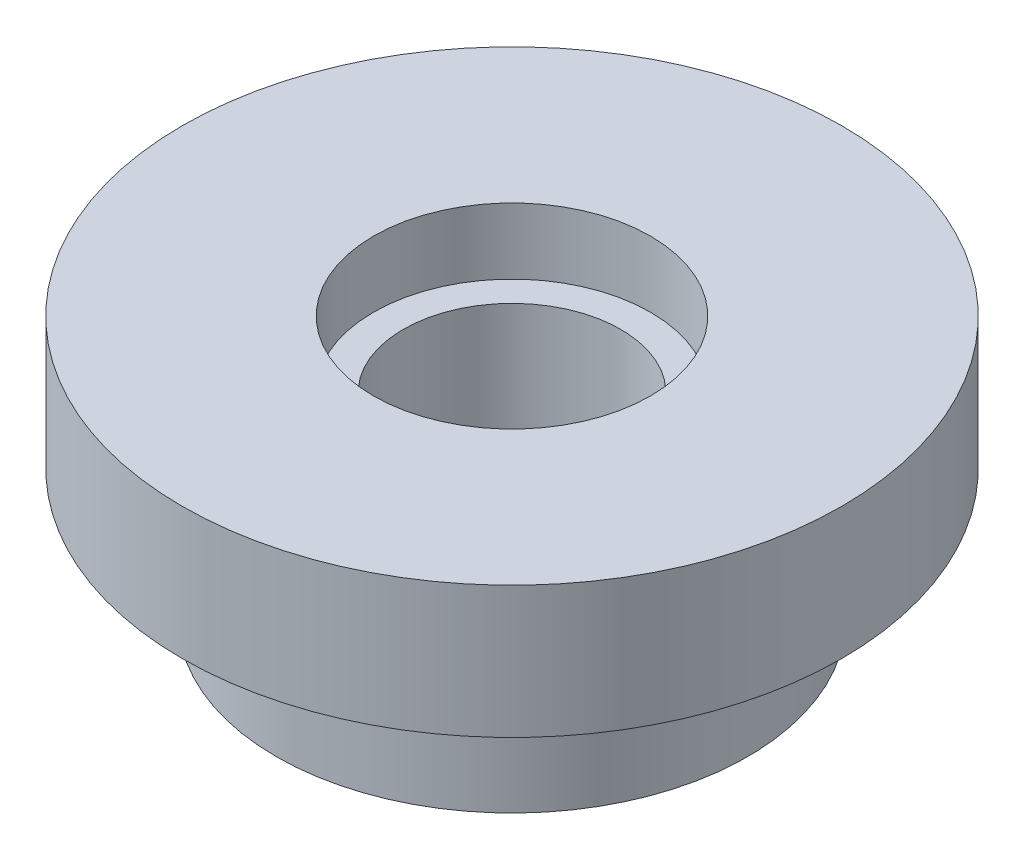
ISO-10303-21;
HEADER;
FILE_DESCRIPTION(('STEP AP214'),'2;1');
FILE_NAME('part.step','',(''),(''),'','','');
FILE_SCHEMA(('AUTOMOTIVE_DESIGN { 1 0 10303 214 1 1 1 1 }'));
ENDSEC;
DATA;
#1=APPLICATION_CONTEXT('core data for automotive mechanical design processes');
#2=APPLICATION_PROTOCOL_DEFINITION('international standard','automotive_design',2000,#1);
#3=PRODUCT_CONTEXT('',#1,'mechanical');
#4=PRODUCT('Part','Part','',(#3));
#5=PRODUCT_RELATED_PRODUCT_CATEGORY('part','',(#4));
#6=PRODUCT_DEFINITION_FORMATION('','',#4);
#7=PRODUCT_DEFINITION_CONTEXT('part definition',#1,'design');
#8=PRODUCT_DEFINITION('design','',#6,#7);
#9=PRODUCT_DEFINITION_SHAPE('','',#8);
#10=(LENGTH_UNIT() NAMED_UNIT(*) SI_UNIT(.MILLI.,.METRE.));
#11=(NAMED_UNIT(*) PLANE_ANGLE_UNIT() SI_UNIT($,.RADIAN.));
#12=(NAMED_UNIT(*) SI_UNIT($,.STERADIAN.) SOLID_ANGLE_UNIT());
#13=UNCERTAINTY_MEASURE_WITH_UNIT(LENGTH_MEASURE(1.E-05),#10,'distance_accuracy_value','');
#14=(GEOMETRIC_REPRESENTATION_CONTEXT(3) GLOBAL_UNCERTAINTY_ASSIGNED_CONTEXT((#13)) GLOBAL_UNIT_ASSIGNED_CONTEXT((#10,
#11,#12)) REPRESENTATION_CONTEXT('',''));
#15=CARTESIAN_POINT('',(0.,0.,0.));
#16=DIRECTION('',(0.,0.,1.));
#17=DIRECTION('',(1.,0.,0.));
#18=AXIS2_PLACEMENT_3D('',#15,#16,#17);
#19=CARTESIAN_POINT('',(0.,0.,0.));
#20=DIRECTION('',(0.,1.,0.));
#21=DIRECTION('',(0.,0.,1.));
#22=AXIS2_PLACEMENT_3D('',#19,#20,#21);
#23=PLANE('',#22);
#24=CARTESIAN_POINT('',(0.,0.,0.));
#25=DIRECTION('',(0.,1.,0.));
#26=DIRECTION('',(0.,0.,1.));
#27=AXIS2_PLACEMENT_3D('',#24,#25,#26);
#28=CIRCLE('',#27,16.5);
#29=CARTESIAN_POINT('',(0.,0.,16.5));
#30=VERTEX_POINT('',#29);
#31=EDGE_CURVE('E38',#30,#30,#28,.T.);
#32=ORIENTED_EDGE('',*,*,#31,.T.);
#33=EDGE_LOOP('',(#32));
#34=FACE_BOUND('',#33,.T.);
#35=CARTESIAN_POINT('',(0.,0.,0.));
#36=DIRECTION('',(0.,-1.,0.));
#37=DIRECTION('',(0.,0.,-1.));
#38=AXIS2_PLACEMENT_3D('',#35,#36,#37);
#39=CIRCLE('',#38,35.75);
#40=CARTESIAN_POINT('',(0.,0.,-35.75));
#41=VERTEX_POINT('',#40);
#42=EDGE_CURVE('E57',#41,#41,#39,.T.);
#43=ORIENTED_EDGE('',*,*,#42,.T.);
#44=EDGE_LOOP('',(#43));
#45=FACE_BOUND('',#44,.T.);
#46=ADVANCED_FACE('F30',(#34,#45),#23,.F.);
#47=CARTESIAN_POINT('',(0.,40.,0.));
#48=DIRECTION('',(0.,-1.,0.));
#49=DIRECTION('',(0.,0.,-1.));
#50=AXIS2_PLACEMENT_3D('',#47,#48,#49);
#51=CYLINDRICAL_SURFACE('',#50,50.);
#52=CARTESIAN_POINT('',(0.,40.,0.));
#53=DIRECTION('',(0.,1.,0.));
#54=DIRECTION('',(0.,0.,1.));
#55=AXIS2_PLACEMENT_3D('',#52,#53,#54);
#56=CIRCLE('',#55,50.);
#57=CARTESIAN_POINT('',(0.,40.,50.));
#58=VERTEX_POINT('',#57);
#59=EDGE_CURVE('E11',#58,#58,#56,.T.);
#60=ORIENTED_EDGE('',*,*,#59,.F.);
#61=EDGE_LOOP('',(#60));
#62=FACE_BOUND('',#61,.T.);
#63=CARTESIAN_POINT('',(0.,20.,0.));
#64=DIRECTION('',(0.,-1.,0.));
#65=DIRECTION('',(0.,0.,-1.));
#66=AXIS2_PLACEMENT_3D('',#63,#64,#65);
#67=CIRCLE('',#66,50.);
#68=CARTESIAN_POINT('',(0.,20.,-50.));
#69=VERTEX_POINT('',#68);
#70=EDGE_CURVE('E34',#69,#69,#67,.T.);
#71=ORIENTED_EDGE('',*,*,#70,.F.);
#72=EDGE_LOOP('',(#71));
#73=FACE_BOUND('',#72,.T.);
#74=ADVANCED_FACE('F32',(#62,#73),#51,.T.);
#75=CARTESIAN_POINT('',(0.,40.,0.));
#76=DIRECTION('',(0.,-1.,0.));
#77=DIRECTION('',(0.,0.,-1.));
#78=AXIS2_PLACEMENT_3D('',#75,#76,#77);
#79=CYLINDRICAL_SURFACE('',#78,16.5);
#80=ORIENTED_EDGE('',*,*,#31,.F.);
#81=EDGE_LOOP('',(#80));
#82=FACE_BOUND('',#81,.T.);
#83=CARTESIAN_POINT('',(0.,30.,0.));
#84=DIRECTION('',(0.,1.,0.));
#85=DIRECTION('',(0.,0.,1.));
#86=AXIS2_PLACEMENT_3D('',#83,#84,#85);
#87=CIRCLE('',#86,16.5);
#88=CARTESIAN_POINT('',(0.,30.,16.5));
#89=VERTEX_POINT('',#88);
#90=EDGE_CURVE('E43',#89,#89,#87,.T.);
#91=ORIENTED_EDGE('',*,*,#90,.T.);
#92=EDGE_LOOP('',(#91));
#93=FACE_BOUND('',#92,.T.);
#94=ADVANCED_FACE('F70',(#82,#93),#79,.F.);
#95=CARTESIAN_POINT('',(0.,40.,0.));
#96=DIRECTION('',(0.,1.,0.));
#97=DIRECTION('',(0.,0.,1.));
#98=AXIS2_PLACEMENT_3D('',#95,#96,#97);
#99=PLANE('',#98);
#100=CARTESIAN_POINT('',(0.,40.,0.));
#101=DIRECTION('',(0.,1.,0.));
#102=DIRECTION('',(0.,0.,1.));
#103=AXIS2_PLACEMENT_3D('',#100,#101,#102);
#104=CIRCLE('',#103,21.);
#105=CARTESIAN_POINT('',(0.,40.,21.));
#106=VERTEX_POINT('',#105);
#107=EDGE_CURVE('E51',#106,#106,#104,.T.);
#108=ORIENTED_EDGE('',*,*,#107,.F.);
#109=EDGE_LOOP('',(#108));
#110=FACE_BOUND('',#109,.T.);
#111=ORIENTED_EDGE('',*,*,#59,.T.);
#112=EDGE_LOOP('',(#111));
#113=FACE_BOUND('',#112,.T.);
#114=ADVANCED_FACE('F76',(#110,#113),#99,.T.);
#115=CARTESIAN_POINT('',(0.,30.,0.));
#116=DIRECTION('',(0.,1.,0.));
#117=DIRECTION('',(0.,0.,1.));
#118=AXIS2_PLACEMENT_3D('',#115,#116,#117);
#119=CYLINDRICAL_SURFACE('',#118,21.);
#120=CARTESIAN_POINT('',(0.,30.,0.));
#121=DIRECTION('',(0.,1.,0.));
#122=DIRECTION('',(0.,0.,1.));
#123=AXIS2_PLACEMENT_3D('',#120,#121,#122);
#124=CIRCLE('',#123,21.);
#125=CARTESIAN_POINT('',(0.,30.,21.));
#126=VERTEX_POINT('',#125);
#127=EDGE_CURVE('E47',#126,#126,#124,.T.);
#128=ORIENTED_EDGE('',*,*,#127,.F.);
#129=EDGE_LOOP('',(#128));
#130=FACE_BOUND('',#129,.T.);
#131=ORIENTED_EDGE('',*,*,#107,.T.);
#132=EDGE_LOOP('',(#131));
#133=FACE_BOUND('',#132,.T.);
#134=ADVANCED_FACE('F85',(#130,#133),#119,.F.);
#135=CARTESIAN_POINT('',(0.,30.,0.));
#136=DIRECTION('',(0.,1.,0.));
#137=DIRECTION('',(0.,0.,1.));
#138=AXIS2_PLACEMENT_3D('',#135,#136,#137);
#139=PLANE('',#138);
#140=ORIENTED_EDGE('',*,*,#90,.F.);
#141=EDGE_LOOP('',(#140));
#142=FACE_BOUND('',#141,.T.);
#143=ORIENTED_EDGE('',*,*,#127,.T.);
#144=EDGE_LOOP('',(#143));
#145=FACE_BOUND('',#144,.T.);
#146=ADVANCED_FACE('F90',(#142,#145),#139,.T.);
#147=CARTESIAN_POINT('',(0.,20.,0.));
#148=DIRECTION('',(0.,-1.,0.));
#149=DIRECTION('',(0.,0.,-1.));
#150=AXIS2_PLACEMENT_3D('',#147,#148,#149);
#151=PLANE('',#150);
#152=CARTESIAN_POINT('',(0.,20.,0.));
#153=DIRECTION('',(0.,-1.,0.));
#154=DIRECTION('',(0.,0.,-1.));
#155=AXIS2_PLACEMENT_3D('',#152,#153,#154);
#156=CIRCLE('',#155,35.75);
#157=CARTESIAN_POINT('',(0.,20.,-35.75));
#158=VERTEX_POINT('',#157);
#159=EDGE_CURVE('E60',#158,#158,#156,.T.);
#160=ORIENTED_EDGE('',*,*,#159,.F.);
#161=EDGE_LOOP('',(#160));
#162=FACE_BOUND('',#161,.T.);
#163=ORIENTED_EDGE('',*,*,#70,.T.);
#164=EDGE_LOOP('',(#163));
#165=FACE_BOUND('',#164,.T.);
#166=ADVANCED_FACE('F67',(#162,#165),#151,.T.);
#167=CARTESIAN_POINT('',(0.,20.,0.));
#168=DIRECTION('',(0.,-1.,0.));
#169=DIRECTION('',(0.,0.,-1.));
#170=AXIS2_PLACEMENT_3D('',#167,#168,#169);
#171=CYLINDRICAL_SURFACE('',#170,35.75);
#172=ORIENTED_EDGE('',*,*,#159,.T.);
#173=EDGE_LOOP('',(#172));
#174=FACE_BOUND('',#173,.T.);
#175=ORIENTED_EDGE('',*,*,#42,.F.);
#176=EDGE_LOOP('',(#175));
#177=FACE_BOUND('',#176,.T.);
#178=ADVANCED_FACE('F97',(#174,#177),#171,.T.);
#179=CLOSED_SHELL('',(#46,#74,#94,#114,#134,#146,#166,#178));
#180=MANIFOLD_SOLID_BREP('B2',#179);
#181=ADVANCED_BREP_SHAPE_REPRESENTATION('',(#18,#180),#14);
#182=SHAPE_DEFINITION_REPRESENTATION(#9,#181);
ENDSEC;
END-ISO-10303-21;
